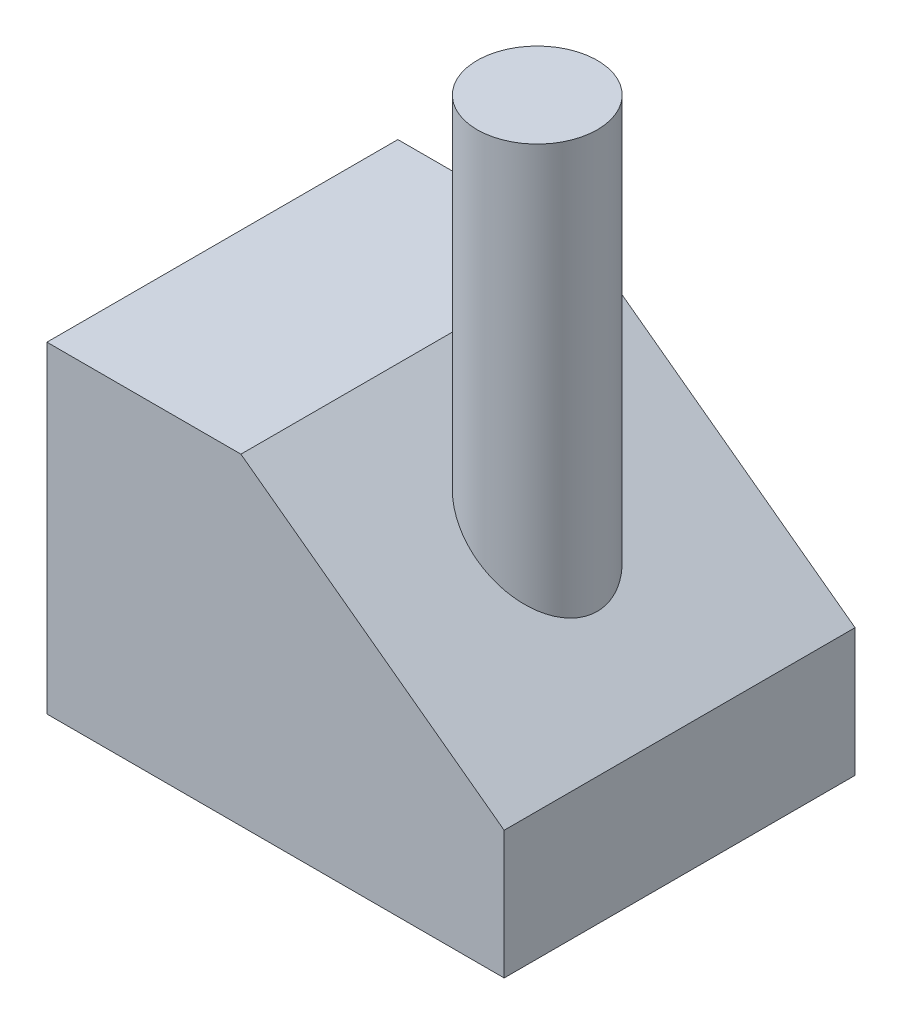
ISO-10303-21;
HEADER;
FILE_DESCRIPTION(('STEP AP214'),'2;1');
FILE_NAME('part.step','',(''),(''),'','','');
FILE_SCHEMA(('AUTOMOTIVE_DESIGN { 1 0 10303 214 1 1 1 1 }'));
ENDSEC;
DATA;
#1=APPLICATION_CONTEXT('core data for automotive mechanical design processes');
#2=APPLICATION_PROTOCOL_DEFINITION('international standard','automotive_design',2000,#1);
#3=PRODUCT_CONTEXT('',#1,'mechanical');
#4=PRODUCT('Part','Part','',(#3));
#5=PRODUCT_RELATED_PRODUCT_CATEGORY('part','',(#4));
#6=PRODUCT_DEFINITION_FORMATION('','',#4);
#7=PRODUCT_DEFINITION_CONTEXT('part definition',#1,'design');
#8=PRODUCT_DEFINITION('design','',#6,#7);
#9=PRODUCT_DEFINITION_SHAPE('','',#8);
#10=(LENGTH_UNIT() NAMED_UNIT(*) SI_UNIT(.MILLI.,.METRE.));
#11=(NAMED_UNIT(*) PLANE_ANGLE_UNIT() SI_UNIT($,.RADIAN.));
#12=(NAMED_UNIT(*) SI_UNIT($,.STERADIAN.) SOLID_ANGLE_UNIT());
#13=UNCERTAINTY_MEASURE_WITH_UNIT(LENGTH_MEASURE(1.E-05),#10,'distance_accuracy_value','');
#14=(GEOMETRIC_REPRESENTATION_CONTEXT(3) GLOBAL_UNCERTAINTY_ASSIGNED_CONTEXT((#13)) GLOBAL_UNIT_ASSIGNED_CONTEXT((#10,
#11,#12)) REPRESENTATION_CONTEXT('',''));
#15=CARTESIAN_POINT('',(0.,0.,0.));
#16=DIRECTION('',(0.,0.,1.));
#17=DIRECTION('',(1.,0.,0.));
#18=AXIS2_PLACEMENT_3D('',#15,#16,#17);
#19=CARTESIAN_POINT('',(109.444117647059,30.6294117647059,42.));
#20=DIRECTION('',(-0.59348584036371,-0.804844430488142,0.));
#21=DIRECTION('',(0.804844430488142,-0.59348584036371,0.));
#22=AXIS2_PLACEMENT_3D('',#19,#20,#21);
#23=PLANE('',#22);
#24=DIRECTION('',(-0.804844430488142,0.59348584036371,0.));
#25=VECTOR('',#24,1.);
#26=CARTESIAN_POINT('',(109.444117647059,30.6294117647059,-42.));
#27=LINE('',#26,#25);
#28=CARTESIAN_POINT('',(109.444117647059,30.6294117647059,-42.));
#29=VERTEX_POINT('',#28);
#30=CARTESIAN_POINT('',(46.4378440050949,77.0897335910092,-42.));
#31=VERTEX_POINT('',#30);
#32=EDGE_CURVE('E69',#29,#31,#27,.T.);
#33=ORIENTED_EDGE('',*,*,#32,.T.);
#34=DIRECTION('',(0.,0.,-1.));
#35=VECTOR('',#34,1.);
#36=CARTESIAN_POINT('',(46.4378440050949,77.0897335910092,42.));
#37=LINE('',#36,#35);
#38=CARTESIAN_POINT('',(46.4378440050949,77.0897335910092,42.));
#39=VERTEX_POINT('',#38);
#40=EDGE_CURVE('E101',#39,#31,#37,.T.);
#41=ORIENTED_EDGE('',*,*,#40,.F.);
#42=DIRECTION('',(-0.804844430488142,0.59348584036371,0.));
#43=VECTOR('',#42,1.);
#44=CARTESIAN_POINT('',(109.444117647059,30.6294117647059,42.));
#45=LINE('',#44,#43);
#46=CARTESIAN_POINT('',(109.444117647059,30.6294117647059,42.));
#47=VERTEX_POINT('',#46);
#48=EDGE_CURVE('E92',#47,#39,#45,.T.);
#49=ORIENTED_EDGE('',*,*,#48,.F.);
#50=DIRECTION('',(0.,0.,-1.));
#51=VECTOR('',#50,1.);
#52=CARTESIAN_POINT('',(109.444117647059,30.6294117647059,42.));
#53=LINE('',#52,#51);
#54=EDGE_CURVE('E96',#47,#29,#53,.T.);
#55=ORIENTED_EDGE('',*,*,#54,.T.);
#56=EDGE_LOOP('',(#33,#41,#49,#55));
#57=FACE_BOUND('',#56,.T.);
#58=CARTESIAN_POINT('',(75.3688249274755,55.7562598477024,0.));
#59=DIRECTION('',(-0.59348584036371,-0.804844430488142,0.));
#60=DIRECTION('',(0.804844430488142,-0.59348584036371,0.));
#61=AXIS2_PLACEMENT_3D('',#58,#59,#60);
#62=ELLIPSE('',#61,17.868107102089,14.381046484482);
#63=CARTESIAN_POINT('',(89.7498714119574,45.1517912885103,0.));
#64=VERTEX_POINT('',#63);
#65=EDGE_CURVE('E11',#64,#64,#62,.F.);
#66=ORIENTED_EDGE('',*,*,#65,.F.);
#67=EDGE_LOOP('',(#66));
#68=FACE_BOUND('',#67,.T.);
#69=ADVANCED_FACE('F32',(#57,#68),#23,.F.);
#70=CARTESIAN_POINT('',(0.,77.0897335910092,42.));
#71=DIRECTION('',(1.,0.,0.));
#72=DIRECTION('',(0.,0.,-1.));
#73=AXIS2_PLACEMENT_3D('',#70,#71,#72);
#74=PLANE('',#73);
#75=DIRECTION('',(0.,-1.,0.));
#76=VECTOR('',#75,1.);
#77=CARTESIAN_POINT('',(0.,77.0897335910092,-42.));
#78=LINE('',#77,#76);
#79=CARTESIAN_POINT('',(0.,77.0897335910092,-42.));
#80=VERTEX_POINT('',#79);
#81=CARTESIAN_POINT('',(0.,0.,-42.));
#82=VERTEX_POINT('',#81);
#83=EDGE_CURVE('E109',#80,#82,#78,.T.);
#84=ORIENTED_EDGE('',*,*,#83,.T.);
#85=DIRECTION('',(0.,0.,-1.));
#86=VECTOR('',#85,1.);
#87=CARTESIAN_POINT('',(0.,0.,42.));
#88=LINE('',#87,#86);
#89=CARTESIAN_POINT('',(0.,0.,42.));
#90=VERTEX_POINT('',#89);
#91=EDGE_CURVE('E41',#90,#82,#88,.T.);
#92=ORIENTED_EDGE('',*,*,#91,.F.);
#93=DIRECTION('',(0.,-1.,0.));
#94=VECTOR('',#93,1.);
#95=CARTESIAN_POINT('',(0.,77.0897335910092,42.));
#96=LINE('',#95,#94);
#97=CARTESIAN_POINT('',(0.,77.0897335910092,42.));
#98=VERTEX_POINT('',#97);
#99=EDGE_CURVE('E118',#98,#90,#96,.T.);
#100=ORIENTED_EDGE('',*,*,#99,.F.);
#101=DIRECTION('',(0.,0.,-1.));
#102=VECTOR('',#101,1.);
#103=CARTESIAN_POINT('',(0.,77.0897335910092,42.));
#104=LINE('',#103,#102);
#105=EDGE_CURVE('E105',#98,#80,#104,.T.);
#106=ORIENTED_EDGE('',*,*,#105,.T.);
#107=EDGE_LOOP('',(#84,#92,#100,#106));
#108=FACE_BOUND('',#107,.T.);
#109=ADVANCED_FACE('F34',(#108),#74,.F.);
#110=CARTESIAN_POINT('',(0.,0.,42.));
#111=DIRECTION('',(0.,1.,0.));
#112=DIRECTION('',(0.,0.,1.));
#113=AXIS2_PLACEMENT_3D('',#110,#111,#112);
#114=PLANE('',#113);
#115=DIRECTION('',(1.,0.,0.));
#116=VECTOR('',#115,1.);
#117=CARTESIAN_POINT('',(0.,0.,-42.));
#118=LINE('',#117,#116);
#119=CARTESIAN_POINT('',(109.444117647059,0.,-42.));
#120=VERTEX_POINT('',#119);
#121=EDGE_CURVE('E112',#82,#120,#118,.T.);
#122=ORIENTED_EDGE('',*,*,#121,.T.);
#123=DIRECTION('',(0.,0.,-1.));
#124=VECTOR('',#123,1.);
#125=CARTESIAN_POINT('',(109.444117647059,0.,42.));
#126=LINE('',#125,#124);
#127=CARTESIAN_POINT('',(109.444117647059,0.,42.));
#128=VERTEX_POINT('',#127);
#129=EDGE_CURVE('E100',#128,#120,#126,.T.);
#130=ORIENTED_EDGE('',*,*,#129,.F.);
#131=DIRECTION('',(1.,0.,0.));
#132=VECTOR('',#131,1.);
#133=CARTESIAN_POINT('',(0.,0.,42.));
#134=LINE('',#133,#132);
#135=EDGE_CURVE('E84',#90,#128,#134,.T.);
#136=ORIENTED_EDGE('',*,*,#135,.F.);
#137=ORIENTED_EDGE('',*,*,#91,.T.);
#138=EDGE_LOOP('',(#122,#130,#136,#137));
#139=FACE_BOUND('',#138,.T.);
#140=ADVANCED_FACE('F122',(#139),#114,.F.);
#141=CARTESIAN_POINT('',(109.444117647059,0.,42.));
#142=DIRECTION('',(-1.,0.,0.));
#143=DIRECTION('',(0.,0.,1.));
#144=AXIS2_PLACEMENT_3D('',#141,#142,#143);
#145=PLANE('',#144);
#146=DIRECTION('',(0.,1.,0.));
#147=VECTOR('',#146,1.);
#148=CARTESIAN_POINT('',(109.444117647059,0.,-42.));
#149=LINE('',#148,#147);
#150=EDGE_CURVE('E99',#120,#29,#149,.T.);
#151=ORIENTED_EDGE('',*,*,#150,.T.);
#152=ORIENTED_EDGE('',*,*,#54,.F.);
#153=DIRECTION('',(0.,1.,0.));
#154=VECTOR('',#153,1.);
#155=CARTESIAN_POINT('',(109.444117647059,0.,42.));
#156=LINE('',#155,#154);
#157=EDGE_CURVE('E88',#128,#47,#156,.T.);
#158=ORIENTED_EDGE('',*,*,#157,.F.);
#159=ORIENTED_EDGE('',*,*,#129,.T.);
#160=EDGE_LOOP('',(#151,#152,#158,#159));
#161=FACE_BOUND('',#160,.T.);
#162=ADVANCED_FACE('F97',(#161),#145,.F.);
#163=CARTESIAN_POINT('',(46.4378440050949,77.0897335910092,42.));
#164=DIRECTION('',(0.,-1.,0.));
#165=DIRECTION('',(0.,0.,-1.));
#166=AXIS2_PLACEMENT_3D('',#163,#164,#165);
#167=PLANE('',#166);
#168=DIRECTION('',(-1.,0.,0.));
#169=VECTOR('',#168,1.);
#170=CARTESIAN_POINT('',(46.4378440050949,77.0897335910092,-42.));
#171=LINE('',#170,#169);
#172=EDGE_CURVE('E75',#31,#80,#171,.T.);
#173=ORIENTED_EDGE('',*,*,#172,.T.);
#174=ORIENTED_EDGE('',*,*,#105,.F.);
#175=DIRECTION('',(-1.,0.,0.));
#176=VECTOR('',#175,1.);
#177=CARTESIAN_POINT('',(46.4378440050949,77.0897335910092,42.));
#178=LINE('',#177,#176);
#179=EDGE_CURVE('E49',#39,#98,#178,.T.);
#180=ORIENTED_EDGE('',*,*,#179,.F.);
#181=ORIENTED_EDGE('',*,*,#40,.T.);
#182=EDGE_LOOP('',(#173,#174,#180,#181));
#183=FACE_BOUND('',#182,.T.);
#184=ADVANCED_FACE('F138',(#183),#167,.F.);
#185=CARTESIAN_POINT('',(0.,0.,42.));
#186=DIRECTION('',(0.,0.,1.));
#187=DIRECTION('',(1.,0.,0.));
#188=AXIS2_PLACEMENT_3D('',#185,#186,#187);
#189=PLANE('',#188);
#190=ORIENTED_EDGE('',*,*,#99,.T.);
#191=ORIENTED_EDGE('',*,*,#135,.T.);
#192=ORIENTED_EDGE('',*,*,#157,.T.);
#193=ORIENTED_EDGE('',*,*,#48,.T.);
#194=ORIENTED_EDGE('',*,*,#179,.T.);
#195=EDGE_LOOP('',(#190,#191,#192,#193,#194));
#196=FACE_BOUND('',#195,.T.);
#197=ADVANCED_FACE('F90',(#196),#189,.T.);
#198=CARTESIAN_POINT('',(0.,0.,-42.));
#199=DIRECTION('',(0.,0.,1.));
#200=DIRECTION('',(1.,0.,0.));
#201=AXIS2_PLACEMENT_3D('',#198,#199,#200);
#202=PLANE('',#201);
#203=ORIENTED_EDGE('',*,*,#83,.F.);
#204=ORIENTED_EDGE('',*,*,#172,.F.);
#205=ORIENTED_EDGE('',*,*,#32,.F.);
#206=ORIENTED_EDGE('',*,*,#150,.F.);
#207=ORIENTED_EDGE('',*,*,#121,.F.);
#208=EDGE_LOOP('',(#203,#204,#205,#206,#207));
#209=FACE_BOUND('',#208,.T.);
#210=ADVANCED_FACE('F127',(#209),#202,.F.);
#211=CARTESIAN_POINT('',(75.3688249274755,145.,0.));
#212=DIRECTION('',(0.,-1.,0.));
#213=DIRECTION('',(0.,0.,-1.));
#214=AXIS2_PLACEMENT_3D('',#211,#212,#213);
#215=CYLINDRICAL_SURFACE('',#214,14.381046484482);
#216=CARTESIAN_POINT('',(75.3688249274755,145.,0.));
#217=DIRECTION('',(0.,1.,0.));
#218=DIRECTION('',(0.,0.,1.));
#219=AXIS2_PLACEMENT_3D('',#216,#217,#218);
#220=CIRCLE('',#219,14.381046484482);
#221=CARTESIAN_POINT('',(75.3688249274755,145.,14.381046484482));
#222=VERTEX_POINT('',#221);
#223=EDGE_CURVE('E113',#222,#222,#220,.T.);
#224=ORIENTED_EDGE('',*,*,#223,.F.);
#225=EDGE_LOOP('',(#224));
#226=FACE_BOUND('',#225,.T.);
#227=ORIENTED_EDGE('',*,*,#65,.T.);
#228=EDGE_LOOP('',(#227));
#229=FACE_BOUND('',#228,.T.);
#230=ADVANCED_FACE('F129',(#226,#229),#215,.T.);
#231=CARTESIAN_POINT('',(75.3688249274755,145.,0.));
#232=DIRECTION('',(0.,1.,0.));
#233=DIRECTION('',(0.,0.,1.));
#234=AXIS2_PLACEMENT_3D('',#231,#232,#233);
#235=PLANE('',#234);
#236=ORIENTED_EDGE('',*,*,#223,.T.);
#237=EDGE_LOOP('',(#236));
#238=FACE_BOUND('',#237,.T.);
#239=ADVANCED_FACE('F135',(#238),#235,.T.);
#240=CLOSED_SHELL('',(#69,#109,#140,#162,#184,#197,#210,#230,#239));
#241=MANIFOLD_SOLID_BREP('B2',#240);
#242=ADVANCED_BREP_SHAPE_REPRESENTATION('',(#18,#241),#14);
#243=SHAPE_DEFINITION_REPRESENTATION(#9,#242);
ENDSEC;
END-ISO-10303-21;
